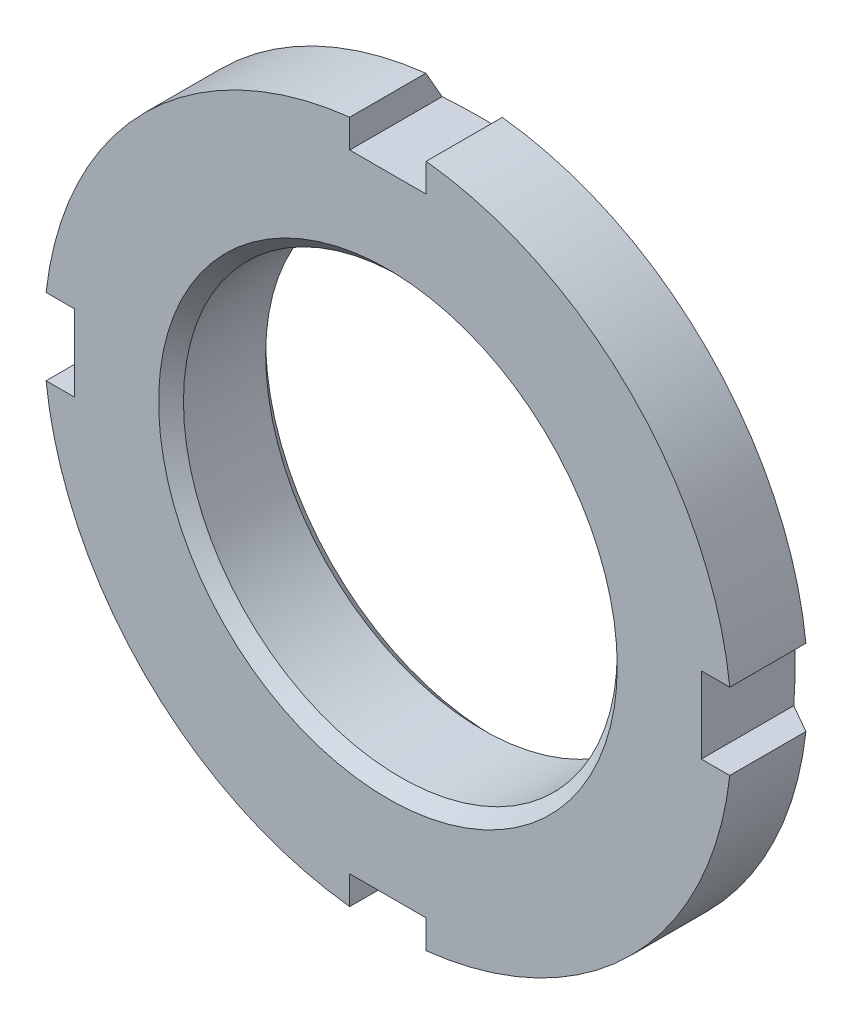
from build123d import *

# Parameters (mm, degrees)
SKETCH2_R          = 45
CUT_EXTRUDE1_DEPTH = 7


with BuildPart() as part:
    # Sketch1 → Revolve1 (revolve)
    with BuildSketch(Plane(origin=(0, 0, 0), x_dir=(0, 0, -1), z_dir=(1, 0, 0)), mode=Mode.PRIVATE) as revolve1_sk:
        Polygon((0, 22.5), (0, 15), (0.812, 14.188), (6.188, 14.188), (7, 15), (7, 19), (4.979274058, 22.5), align=None)
    revolve(revolve1_sk.sketch.rotate(Axis((0, 0, -7), (0, 0, 1)), 270), axis=Axis((0, 0, -7), (0, 0, 1)))

    # Sketch2 → Cut-Extrude1 (cut)
    with BuildSketch(Plane.XY):
        Circle(SKETCH2_R)
        with BuildLine():
            Line((-34.524988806, 2.5), (-20.5, 2.5))
            Line((-20.5, 2.5), (-20.5, -2.5))
            Line((-20.5, -2.5), (-34.524988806, -2.5))
            ThreePointArc((-34.524988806, -2.5), (-24.476773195, -24.476773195), (-2.5, -34.524988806))
            Line((-2.5, -34.524988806), (-2.5, -20.5))
            Line((-2.5, -20.5), (2.5, -20.5))
            Line((2.5, -20.5), (2.5, -34.524988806))
            ThreePointArc((2.5, -34.524988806), (24.476773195, -24.476773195), (34.524988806, -2.5))
            Line((34.524988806, -2.5), (20.5, -2.5))
            Line((20.5, -2.5), (20.5, 2.5))
            Line((20.5, 2.5), (34.524988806, 2.5))
            ThreePointArc((34.524988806, 2.5), (24.476773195, 24.476773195), (2.5, 34.524988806))
            Line((2.5, 34.524988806), (2.5, 20.5))
            Line((2.5, 20.5), (-2.5, 20.5))
            Line((-2.5, 20.5), (-2.5, 34.524988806))
            ThreePointArc((-2.5, 34.524988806), (-24.476773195, 24.476773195), (-34.524988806, 2.5))
        make_face(mode=Mode.SUBTRACT)
    extrude(amount=-CUT_EXTRUDE1_DEPTH, mode=Mode.SUBTRACT)


solid = part.part
